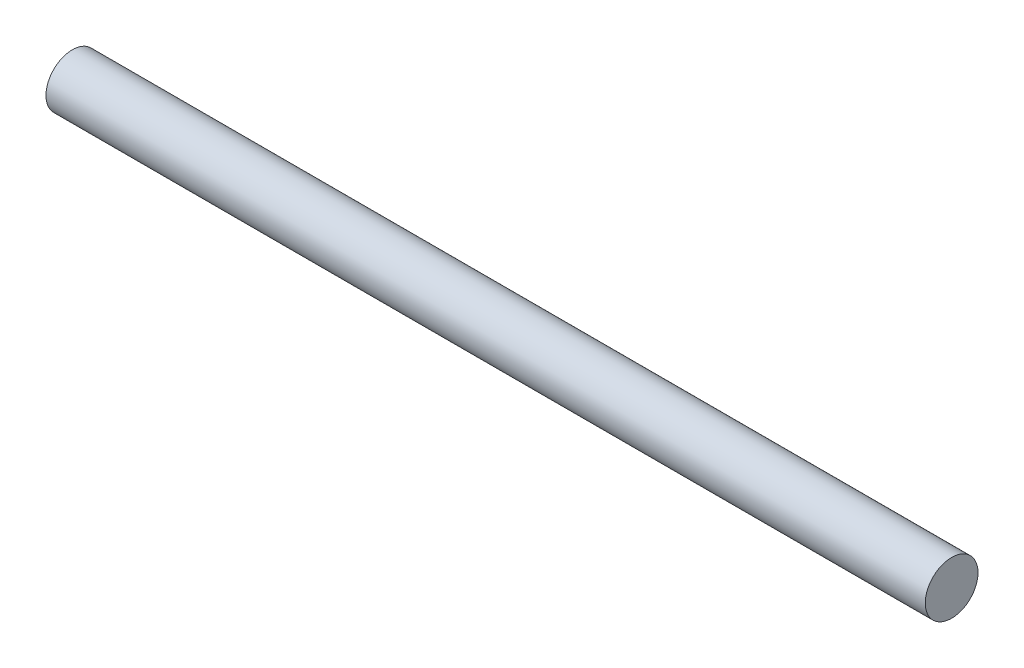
from build123d import *

# Parameters (mm, degrees)
SKETCH1_R           = 7.5
BOSS_EXTRUDE1_DEPTH = 125


with BuildPart() as part:
    # Sketch1 → Boss-Extrude1 (new, symmetric)
    with BuildSketch(Plane(origin=(0, 0, 0), x_dir=(0, 0, -1), z_dir=(1, 0, 0))):
        Circle(SKETCH1_R)
    extrude(amount=BOSS_EXTRUDE1_DEPTH, both=True)


solid = part.part
